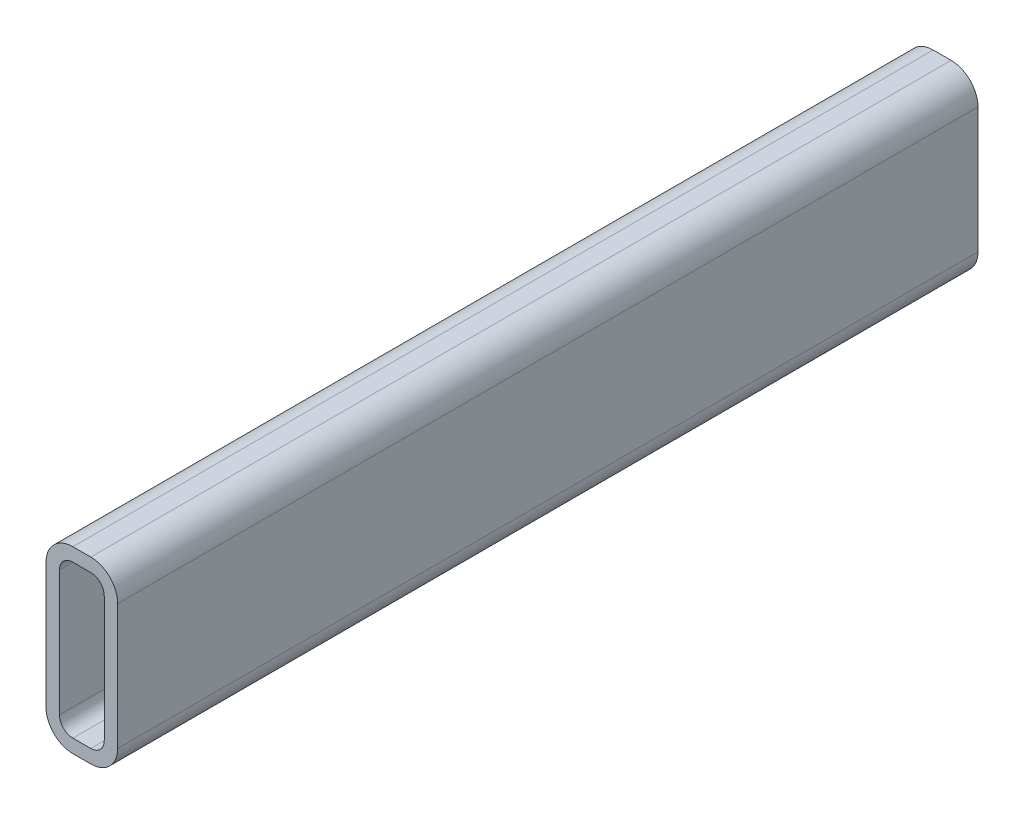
from build123d import *

# Parameters (mm, degrees)
BOSS_EXTRUDE1_DEPTH = 304.8


with BuildPart() as part:
    # Sketch1 → Boss-Extrude1 (new body)
    with BuildSketch(Plane.XY):
        with BuildLine():
            Line((9.525, 63.5), (15.875, 63.5))
            ThreePointArc((15.875, 63.5), (22.610192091, 60.710192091), (25.4, 53.975))
            Line((25.4, 53.975), (25.4, 9.525))
            ThreePointArc((25.4, 9.525), (22.610192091, 2.789807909), (15.875, 0))
            Line((15.875, 0), (9.525, 0))
            ThreePointArc((9.525, 0), (2.789807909, 2.789807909), (0, 9.525))
            Line((0, 9.525), (0, 53.975))
            ThreePointArc((0, 53.975), (2.789807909, 60.710192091), (9.525, 63.5))
        make_face()
        with BuildLine():
            Line((9.525, 58.7375), (15.875, 58.7375))
            ThreePointArc((15.875, 58.7375), (19.242596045, 57.342596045), (20.6375, 53.975))
            Line((20.6375, 53.975), (20.6375, 9.525))
            ThreePointArc((20.6375, 9.525), (19.242596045, 6.157403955), (15.875, 4.7625))
            Line((15.875, 4.7625), (9.525, 4.7625))
            ThreePointArc((9.525, 4.7625), (6.157403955, 6.157403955), (4.7625, 9.525))
            Line((4.7625, 9.525), (4.7625, 53.975))
            ThreePointArc((4.7625, 53.975), (6.157403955, 57.342596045), (9.525, 58.7375))
        make_face(mode=Mode.SUBTRACT)
    extrude(amount=BOSS_EXTRUDE1_DEPTH)


solid = part.part
